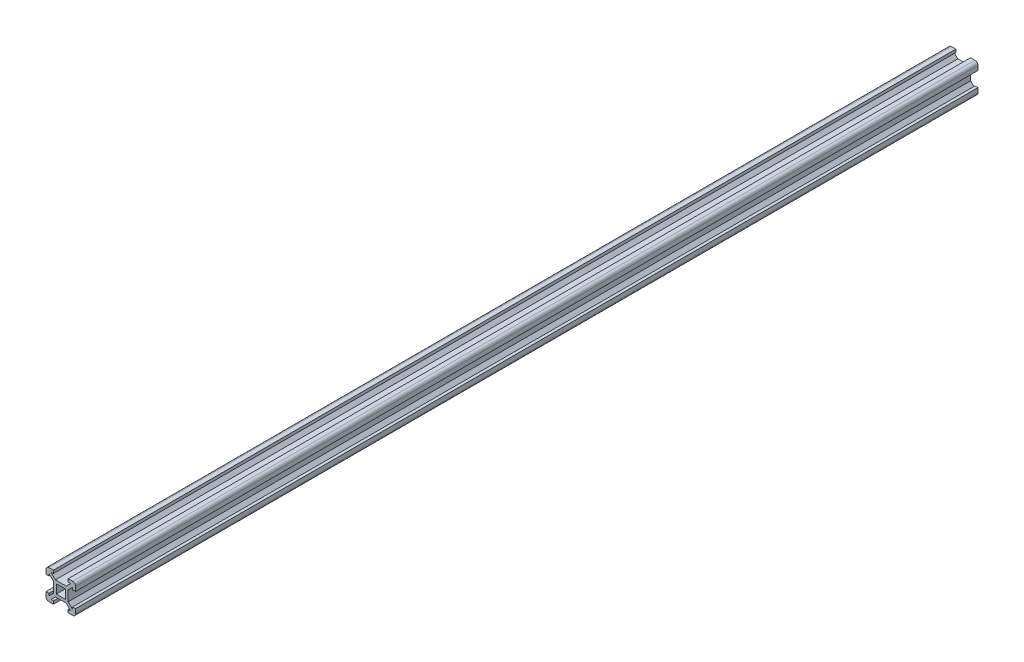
from build123d import *

# Parameters (mm, degrees)
ESQUISSE1_W      = 6.085415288
ESQUISSE1_H      = 6.085415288
EXTRUSION1_DEPTH = 610


with BuildPart() as part:
    # Esquisse1 → Extrusion1 (new body)
    with BuildSketch(Plane.XY):
        with BuildLine():
            Line((5, 13.522668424), (5, 6.477331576))
            Line((5, 6.477331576), (2, 3.521413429))
            Line((2, 3.521413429), (2, 5))
            Line((2, 5), (0, 5))
            Line((0, 5), (0, 2))
            ThreePointArc((0, 2), (0.585786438, 0.585786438), (2, 0))
            Line((2, 0), (5, 0))
            Line((5, 0), (5, 2))
            Line((5, 2), (3.305493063, 2))
            Line((3.305493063, 2), (6.350232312, 5))
            Line((6.350232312, 5), (13.649767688, 5))
            Line((13.649767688, 5), (16.694506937, 2))
            Line((16.694506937, 2), (15, 2))
            Line((15, 2), (15, 0))
            Line((15, 0), (18, 0))
            ThreePointArc((18, 0), (19.414213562, 0.585786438), (20, 2))
            Line((20, 2), (20, 5))
            Line((20, 5), (18, 5))
            Line((18, 5), (18, 3.521413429))
            Line((18, 3.521413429), (15, 6.477331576))
            Line((15, 6.477331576), (15, 13.522668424))
            Line((15, 13.522668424), (18, 16.478586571))
            Line((18, 16.478586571), (18, 15))
            Line((18, 15), (20, 15))
            Line((20, 15), (20, 18))
            ThreePointArc((20, 18), (19.414213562, 19.414213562), (18, 20))
            Line((18, 20), (15, 20))
            Line((15, 20), (15, 18))
            Line((15, 18), (16.694506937, 18))
            Line((16.694506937, 18), (13.649767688, 15))
            Line((13.649767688, 15), (6.350232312, 15))
            Line((6.350232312, 15), (3.305493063, 18))
            Line((3.305493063, 18), (5, 18))
            Line((5, 18), (5, 20))
            Line((5, 20), (2, 20))
            ThreePointArc((2, 20), (0.585786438, 19.414213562), (0, 18))
            Line((0, 18), (0, 15))
            Line((0, 15), (2, 15))
            Line((2, 15), (2, 16.478586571))
            Line((2, 16.478586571), (5, 13.522668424))
        make_face()
        with Locations((10, 10)):
            Rectangle(ESQUISSE1_W, ESQUISSE1_H, mode=Mode.SUBTRACT)
    extrude(amount=EXTRUSION1_DEPTH)


solid = part.part
